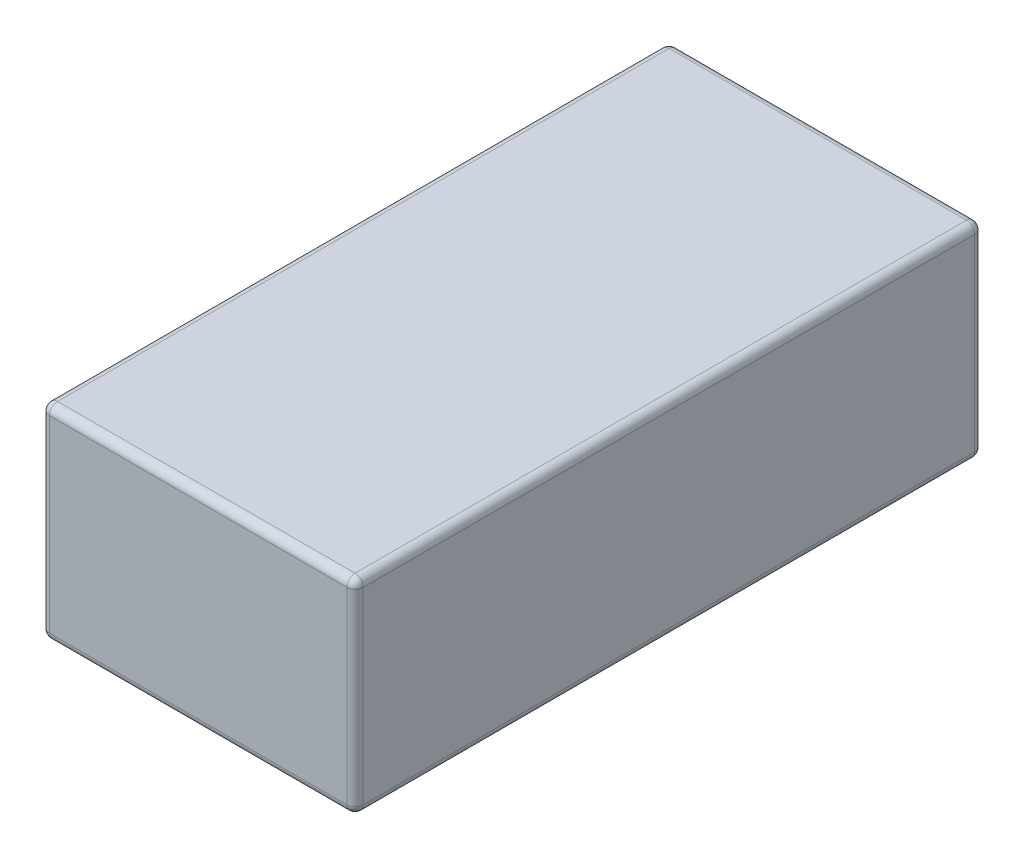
ISO-10303-21;
HEADER;
FILE_DESCRIPTION(('STEP AP214'),'2;1');
FILE_NAME('part.step','',(''),(''),'','','');
FILE_SCHEMA(('AUTOMOTIVE_DESIGN { 1 0 10303 214 1 1 1 1 }'));
ENDSEC;
DATA;
#1=APPLICATION_CONTEXT('core data for automotive mechanical design processes');
#2=APPLICATION_PROTOCOL_DEFINITION('international standard','automotive_design',2000,#1);
#3=PRODUCT_CONTEXT('',#1,'mechanical');
#4=PRODUCT('Part','Part','',(#3));
#5=PRODUCT_RELATED_PRODUCT_CATEGORY('part','',(#4));
#6=PRODUCT_DEFINITION_FORMATION('','',#4);
#7=PRODUCT_DEFINITION_CONTEXT('part definition',#1,'design');
#8=PRODUCT_DEFINITION('design','',#6,#7);
#9=PRODUCT_DEFINITION_SHAPE('','',#8);
#10=(LENGTH_UNIT() NAMED_UNIT(*) SI_UNIT(.MILLI.,.METRE.));
#11=(NAMED_UNIT(*) PLANE_ANGLE_UNIT() SI_UNIT($,.RADIAN.));
#12=(NAMED_UNIT(*) SI_UNIT($,.STERADIAN.) SOLID_ANGLE_UNIT());
#13=UNCERTAINTY_MEASURE_WITH_UNIT(LENGTH_MEASURE(1.E-05),#10,'distance_accuracy_value','');
#14=(GEOMETRIC_REPRESENTATION_CONTEXT(3) GLOBAL_UNCERTAINTY_ASSIGNED_CONTEXT((#13)) GLOBAL_UNIT_ASSIGNED_CONTEXT((#10,
#11,#12)) REPRESENTATION_CONTEXT('',''));
#15=CARTESIAN_POINT('',(0.,0.,0.));
#16=DIRECTION('',(0.,0.,1.));
#17=DIRECTION('',(1.,0.,0.));
#18=AXIS2_PLACEMENT_3D('',#15,#16,#17);
#19=CARTESIAN_POINT('',(57.5,37.5,115.));
#20=DIRECTION('',(-1.,0.,0.));
#21=DIRECTION('',(0.,-1.,0.));
#22=AXIS2_PLACEMENT_3D('',#19,#20,#21);
#23=PLANE('',#22);
#24=DIRECTION('',(0.,1.,0.));
#25=VECTOR('',#24,1.);
#26=CARTESIAN_POINT('',(57.5,-37.5,112.));
#27=LINE('',#26,#25);
#28=CARTESIAN_POINT('',(57.5,34.5,112.));
#29=VERTEX_POINT('',#28);
#30=CARTESIAN_POINT('',(57.5,-34.5,112.));
#31=VERTEX_POINT('',#30);
#32=EDGE_CURVE('E141',#29,#31,#27,.F.);
#33=ORIENTED_EDGE('',*,*,#32,.T.);
#34=DIRECTION('',(0.,0.,-1.));
#35=VECTOR('',#34,1.);
#36=CARTESIAN_POINT('',(57.5,-34.5,115.));
#37=LINE('',#36,#35);
#38=CARTESIAN_POINT('',(57.5,-34.5,-112.));
#39=VERTEX_POINT('',#38);
#40=EDGE_CURVE('E137',#31,#39,#37,.T.);
#41=ORIENTED_EDGE('',*,*,#40,.T.);
#42=DIRECTION('',(0.,1.,0.));
#43=VECTOR('',#42,1.);
#44=CARTESIAN_POINT('',(57.5,37.5,-112.));
#45=LINE('',#44,#43);
#46=CARTESIAN_POINT('',(57.5,34.5,-112.));
#47=VERTEX_POINT('',#46);
#48=EDGE_CURVE('E132',#39,#47,#45,.T.);
#49=ORIENTED_EDGE('',*,*,#48,.T.);
#50=DIRECTION('',(0.,0.,-1.));
#51=VECTOR('',#50,1.);
#52=CARTESIAN_POINT('',(57.5,34.5,115.));
#53=LINE('',#52,#51);
#54=EDGE_CURVE('E134',#47,#29,#53,.F.);
#55=ORIENTED_EDGE('',*,*,#54,.T.);
#56=EDGE_LOOP('',(#33,#41,#49,#55));
#57=FACE_BOUND('',#56,.T.);
#58=ADVANCED_FACE('F39',(#57),#23,.F.);
#59=CARTESIAN_POINT('',(-57.5,37.5,115.));
#60=DIRECTION('',(0.,-1.,0.));
#61=DIRECTION('',(0.,0.,-1.));
#62=AXIS2_PLACEMENT_3D('',#59,#60,#61);
#63=PLANE('',#62);
#64=DIRECTION('',(0.,0.,-1.));
#65=VECTOR('',#64,1.);
#66=CARTESIAN_POINT('',(-54.5,37.5,115.));
#67=LINE('',#66,#65);
#68=CARTESIAN_POINT('',(-54.5,37.5,-112.));
#69=VERTEX_POINT('',#68);
#70=CARTESIAN_POINT('',(-54.5,37.5,112.));
#71=VERTEX_POINT('',#70);
#72=EDGE_CURVE('E263',#69,#71,#67,.F.);
#73=ORIENTED_EDGE('',*,*,#72,.T.);
#74=DIRECTION('',(-1.,0.,0.));
#75=VECTOR('',#74,1.);
#76=CARTESIAN_POINT('',(57.5,37.5,112.));
#77=LINE('',#76,#75);
#78=CARTESIAN_POINT('',(54.5,37.5,112.));
#79=VERTEX_POINT('',#78);
#80=EDGE_CURVE('E266',#71,#79,#77,.F.);
#81=ORIENTED_EDGE('',*,*,#80,.T.);
#82=DIRECTION('',(0.,0.,-1.));
#83=VECTOR('',#82,1.);
#84=CARTESIAN_POINT('',(54.5,37.5,115.));
#85=LINE('',#84,#83);
#86=CARTESIAN_POINT('',(54.5,37.5,-112.));
#87=VERTEX_POINT('',#86);
#88=EDGE_CURVE('E253',#79,#87,#85,.T.);
#89=ORIENTED_EDGE('',*,*,#88,.T.);
#90=DIRECTION('',(-1.,0.,0.));
#91=VECTOR('',#90,1.);
#92=CARTESIAN_POINT('',(-57.5,37.5,-112.));
#93=LINE('',#92,#91);
#94=EDGE_CURVE('E257',#87,#69,#93,.T.);
#95=ORIENTED_EDGE('',*,*,#94,.T.);
#96=EDGE_LOOP('',(#73,#81,#89,#95));
#97=FACE_BOUND('',#96,.T.);
#98=ADVANCED_FACE('F376',(#97),#63,.F.);
#99=CARTESIAN_POINT('',(-57.5,37.5,115.));
#100=DIRECTION('',(1.,0.,0.));
#101=DIRECTION('',(0.,1.,0.));
#102=AXIS2_PLACEMENT_3D('',#99,#100,#101);
#103=PLANE('',#102);
#104=DIRECTION('',(0.,0.,-1.));
#105=VECTOR('',#104,1.);
#106=CARTESIAN_POINT('',(-57.5,-34.5,115.));
#107=LINE('',#106,#105);
#108=CARTESIAN_POINT('',(-57.5,-34.5,-112.));
#109=VERTEX_POINT('',#108);
#110=CARTESIAN_POINT('',(-57.5,-34.5,112.));
#111=VERTEX_POINT('',#110);
#112=EDGE_CURVE('E242',#109,#111,#107,.F.);
#113=ORIENTED_EDGE('',*,*,#112,.T.);
#114=DIRECTION('',(0.,-1.,0.));
#115=VECTOR('',#114,1.);
#116=CARTESIAN_POINT('',(-57.5,37.5,112.));
#117=LINE('',#116,#115);
#118=CARTESIAN_POINT('',(-57.5,34.5,112.));
#119=VERTEX_POINT('',#118);
#120=EDGE_CURVE('E246',#111,#119,#117,.F.);
#121=ORIENTED_EDGE('',*,*,#120,.T.);
#122=DIRECTION('',(0.,0.,-1.));
#123=VECTOR('',#122,1.);
#124=CARTESIAN_POINT('',(-57.5,34.5,115.));
#125=LINE('',#124,#123);
#126=CARTESIAN_POINT('',(-57.5,34.5,-112.));
#127=VERTEX_POINT('',#126);
#128=EDGE_CURVE('E238',#119,#127,#125,.T.);
#129=ORIENTED_EDGE('',*,*,#128,.T.);
#130=DIRECTION('',(0.,-1.,0.));
#131=VECTOR('',#130,1.);
#132=CARTESIAN_POINT('',(-57.5,37.5,-112.));
#133=LINE('',#132,#131);
#134=EDGE_CURVE('E243',#127,#109,#133,.T.);
#135=ORIENTED_EDGE('',*,*,#134,.T.);
#136=EDGE_LOOP('',(#113,#121,#129,#135));
#137=FACE_BOUND('',#136,.T.);
#138=ADVANCED_FACE('F247',(#137),#103,.F.);
#139=CARTESIAN_POINT('',(-57.5,-37.5,115.));
#140=DIRECTION('',(0.,1.,0.));
#141=DIRECTION('',(0.,0.,1.));
#142=AXIS2_PLACEMENT_3D('',#139,#140,#141);
#143=PLANE('',#142);
#144=DIRECTION('',(1.,0.,0.));
#145=VECTOR('',#144,1.);
#146=CARTESIAN_POINT('',(-57.5,-37.5,-112.));
#147=LINE('',#146,#145);
#148=CARTESIAN_POINT('',(-54.5,-37.5,-112.));
#149=VERTEX_POINT('',#148);
#150=CARTESIAN_POINT('',(54.5,-37.5,-112.));
#151=VERTEX_POINT('',#150);
#152=EDGE_CURVE('E314',#149,#151,#147,.T.);
#153=ORIENTED_EDGE('',*,*,#152,.T.);
#154=DIRECTION('',(0.,0.,-1.));
#155=VECTOR('',#154,1.);
#156=CARTESIAN_POINT('',(54.5,-37.5,115.));
#157=LINE('',#156,#155);
#158=CARTESIAN_POINT('',(54.5,-37.5,112.));
#159=VERTEX_POINT('',#158);
#160=EDGE_CURVE('E308',#151,#159,#157,.F.);
#161=ORIENTED_EDGE('',*,*,#160,.T.);
#162=DIRECTION('',(1.,0.,0.));
#163=VECTOR('',#162,1.);
#164=CARTESIAN_POINT('',(-57.5,-37.5,112.));
#165=LINE('',#164,#163);
#166=CARTESIAN_POINT('',(-54.5,-37.5,112.));
#167=VERTEX_POINT('',#166);
#168=EDGE_CURVE('E301',#159,#167,#165,.F.);
#169=ORIENTED_EDGE('',*,*,#168,.T.);
#170=DIRECTION('',(0.,0.,-1.));
#171=VECTOR('',#170,1.);
#172=CARTESIAN_POINT('',(-54.5,-37.5,115.));
#173=LINE('',#172,#171);
#174=EDGE_CURVE('E309',#167,#149,#173,.T.);
#175=ORIENTED_EDGE('',*,*,#174,.T.);
#176=EDGE_LOOP('',(#153,#161,#169,#175));
#177=FACE_BOUND('',#176,.T.);
#178=ADVANCED_FACE('F312',(#177),#143,.F.);
#179=CARTESIAN_POINT('',(0.,0.,115.));
#180=DIRECTION('',(0.,0.,1.));
#181=DIRECTION('',(1.,0.,0.));
#182=AXIS2_PLACEMENT_3D('',#179,#180,#181);
#183=PLANE('',#182);
#184=DIRECTION('',(0.,-1.,0.));
#185=VECTOR('',#184,1.);
#186=CARTESIAN_POINT('',(-54.5,-37.5,115.));
#187=LINE('',#186,#185);
#188=CARTESIAN_POINT('',(-54.5,34.5,115.));
#189=VERTEX_POINT('',#188);
#190=CARTESIAN_POINT('',(-54.5,-34.5,115.));
#191=VERTEX_POINT('',#190);
#192=EDGE_CURVE('E326',#189,#191,#187,.T.);
#193=ORIENTED_EDGE('',*,*,#192,.T.);
#194=DIRECTION('',(1.,0.,0.));
#195=VECTOR('',#194,1.);
#196=CARTESIAN_POINT('',(57.5,-34.5,115.));
#197=LINE('',#196,#195);
#198=CARTESIAN_POINT('',(54.5,-34.5,115.));
#199=VERTEX_POINT('',#198);
#200=EDGE_CURVE('E330',#191,#199,#197,.T.);
#201=ORIENTED_EDGE('',*,*,#200,.T.);
#202=DIRECTION('',(0.,1.,0.));
#203=VECTOR('',#202,1.);
#204=CARTESIAN_POINT('',(54.5,37.5,115.));
#205=LINE('',#204,#203);
#206=CARTESIAN_POINT('',(54.5,34.5,115.));
#207=VERTEX_POINT('',#206);
#208=EDGE_CURVE('E320',#199,#207,#205,.T.);
#209=ORIENTED_EDGE('',*,*,#208,.T.);
#210=DIRECTION('',(-1.,0.,0.));
#211=VECTOR('',#210,1.);
#212=CARTESIAN_POINT('',(-57.5,34.5,115.));
#213=LINE('',#212,#211);
#214=EDGE_CURVE('E317',#207,#189,#213,.T.);
#215=ORIENTED_EDGE('',*,*,#214,.T.);
#216=EDGE_LOOP('',(#193,#201,#209,#215));
#217=FACE_BOUND('',#216,.T.);
#218=ADVANCED_FACE('F359',(#217),#183,.T.);
#219=CARTESIAN_POINT('',(0.,0.,-115.));
#220=DIRECTION('',(0.,0.,1.));
#221=DIRECTION('',(1.,0.,0.));
#222=AXIS2_PLACEMENT_3D('',#219,#220,#221);
#223=PLANE('',#222);
#224=DIRECTION('',(-1.,0.,0.));
#225=VECTOR('',#224,1.);
#226=CARTESIAN_POINT('',(0.,34.5,-115.));
#227=LINE('',#226,#225);
#228=CARTESIAN_POINT('',(-54.5,34.5,-115.));
#229=VERTEX_POINT('',#228);
#230=CARTESIAN_POINT('',(54.5,34.5,-115.));
#231=VERTEX_POINT('',#230);
#232=EDGE_CURVE('E270',#229,#231,#227,.F.);
#233=ORIENTED_EDGE('',*,*,#232,.T.);
#234=DIRECTION('',(0.,1.,0.));
#235=VECTOR('',#234,1.);
#236=CARTESIAN_POINT('',(54.5,0.,-115.));
#237=LINE('',#236,#235);
#238=CARTESIAN_POINT('',(54.5,-34.5,-115.));
#239=VERTEX_POINT('',#238);
#240=EDGE_CURVE('E11',#231,#239,#237,.F.);
#241=ORIENTED_EDGE('',*,*,#240,.T.);
#242=DIRECTION('',(1.,0.,0.));
#243=VECTOR('',#242,1.);
#244=CARTESIAN_POINT('',(0.,-34.5,-115.));
#245=LINE('',#244,#243);
#246=CARTESIAN_POINT('',(-54.5,-34.5,-115.));
#247=VERTEX_POINT('',#246);
#248=EDGE_CURVE('E49',#239,#247,#245,.F.);
#249=ORIENTED_EDGE('',*,*,#248,.T.);
#250=DIRECTION('',(0.,-1.,0.));
#251=VECTOR('',#250,1.);
#252=CARTESIAN_POINT('',(-54.5,0.,-115.));
#253=LINE('',#252,#251);
#254=EDGE_CURVE('E273',#247,#229,#253,.F.);
#255=ORIENTED_EDGE('',*,*,#254,.T.);
#256=EDGE_LOOP('',(#233,#241,#249,#255));
#257=FACE_BOUND('',#256,.T.);
#258=ADVANCED_FACE('F530',(#257),#223,.F.);
#259=CARTESIAN_POINT('',(-54.5,34.5,115.));
#260=DIRECTION('',(0.,0.,-1.));
#261=DIRECTION('',(-1.,0.,0.));
#262=AXIS2_PLACEMENT_3D('',#259,#260,#261);
#263=CYLINDRICAL_SURFACE('',#262,3.);
#264=CARTESIAN_POINT('',(-54.5,34.5,112.));
#265=DIRECTION('',(0.,0.,1.));
#266=DIRECTION('',(1.,0.,0.));
#267=AXIS2_PLACEMENT_3D('',#264,#265,#266);
#268=CIRCLE('',#267,3.);
#269=EDGE_CURVE('E43',#71,#119,#268,.T.);
#270=ORIENTED_EDGE('',*,*,#269,.F.);
#271=ORIENTED_EDGE('',*,*,#72,.F.);
#272=CARTESIAN_POINT('',(-54.5,34.5,-112.));
#273=DIRECTION('',(0.,0.,-1.));
#274=DIRECTION('',(-1.,0.,0.));
#275=AXIS2_PLACEMENT_3D('',#272,#273,#274);
#276=CIRCLE('',#275,3.);
#277=EDGE_CURVE('E219',#127,#69,#276,.T.);
#278=ORIENTED_EDGE('',*,*,#277,.F.);
#279=ORIENTED_EDGE('',*,*,#128,.F.);
#280=EDGE_LOOP('',(#270,#271,#278,#279));
#281=FACE_BOUND('',#280,.T.);
#282=ADVANCED_FACE('F41',(#281),#263,.T.);
#283=CARTESIAN_POINT('',(-54.5,34.5,112.));
#284=DIRECTION('',(0.,0.,1.));
#285=DIRECTION('',(1.,0.,0.));
#286=AXIS2_PLACEMENT_3D('',#283,#284,#285);
#287=SPHERICAL_SURFACE('',#286,3.);
#288=CARTESIAN_POINT('',(-54.5,34.5,112.));
#289=DIRECTION('',(-1.,0.,0.));
#290=DIRECTION('',(0.,0.,1.));
#291=AXIS2_PLACEMENT_3D('',#288,#289,#290);
#292=CIRCLE('',#291,3.);
#293=EDGE_CURVE('E213',#71,#189,#292,.F.);
#294=ORIENTED_EDGE('',*,*,#293,.F.);
#295=ORIENTED_EDGE('',*,*,#269,.T.);
#296=CARTESIAN_POINT('',(-54.5,34.5,112.));
#297=DIRECTION('',(0.,1.,0.));
#298=DIRECTION('',(0.,0.,1.));
#299=AXIS2_PLACEMENT_3D('',#296,#297,#298);
#300=CIRCLE('',#299,3.);
#301=EDGE_CURVE('E217',#189,#119,#300,.F.);
#302=ORIENTED_EDGE('',*,*,#301,.F.);
#303=EDGE_LOOP('',(#294,#295,#302));
#304=FACE_BOUND('',#303,.T.);
#305=ADVANCED_FACE('F233',(#304),#287,.T.);
#306=CARTESIAN_POINT('',(-54.5,34.5,-112.));
#307=DIRECTION('',(0.,0.,1.));
#308=DIRECTION('',(1.,0.,0.));
#309=AXIS2_PLACEMENT_3D('',#306,#307,#308);
#310=SPHERICAL_SURFACE('',#309,3.);
#311=CARTESIAN_POINT('',(-54.5,34.5,-112.));
#312=DIRECTION('',(0.,1.,0.));
#313=DIRECTION('',(0.,0.,1.));
#314=AXIS2_PLACEMENT_3D('',#311,#312,#313);
#315=CIRCLE('',#314,3.);
#316=EDGE_CURVE('E205',#127,#229,#315,.F.);
#317=ORIENTED_EDGE('',*,*,#316,.F.);
#318=ORIENTED_EDGE('',*,*,#277,.T.);
#319=CARTESIAN_POINT('',(-54.5,34.5,-112.));
#320=DIRECTION('',(-1.,0.,0.));
#321=DIRECTION('',(0.,0.,1.));
#322=AXIS2_PLACEMENT_3D('',#319,#320,#321);
#323=CIRCLE('',#322,3.);
#324=EDGE_CURVE('E209',#229,#69,#323,.F.);
#325=ORIENTED_EDGE('',*,*,#324,.F.);
#326=EDGE_LOOP('',(#317,#318,#325));
#327=FACE_BOUND('',#326,.T.);
#328=ADVANCED_FACE('F509',(#327),#310,.T.);
#329=CARTESIAN_POINT('',(-54.5,0.,112.));
#330=DIRECTION('',(0.,1.,0.));
#331=DIRECTION('',(-1.,0.,0.));
#332=AXIS2_PLACEMENT_3D('',#329,#330,#331);
#333=CYLINDRICAL_SURFACE('',#332,3.);
#334=ORIENTED_EDGE('',*,*,#301,.T.);
#335=ORIENTED_EDGE('',*,*,#120,.F.);
#336=CARTESIAN_POINT('',(-54.5,-34.5,112.));
#337=DIRECTION('',(0.,-1.,0.));
#338=DIRECTION('',(0.,0.,-1.));
#339=AXIS2_PLACEMENT_3D('',#336,#337,#338);
#340=CIRCLE('',#339,3.);
#341=EDGE_CURVE('E197',#191,#111,#340,.T.);
#342=ORIENTED_EDGE('',*,*,#341,.F.);
#343=ORIENTED_EDGE('',*,*,#192,.F.);
#344=EDGE_LOOP('',(#334,#335,#342,#343));
#345=FACE_BOUND('',#344,.T.);
#346=ADVANCED_FACE('F501',(#345),#333,.T.);
#347=CARTESIAN_POINT('',(0.,34.5,112.));
#348=DIRECTION('',(1.,0.,0.));
#349=DIRECTION('',(0.,0.,-1.));
#350=AXIS2_PLACEMENT_3D('',#347,#348,#349);
#351=CYLINDRICAL_SURFACE('',#350,3.);
#352=ORIENTED_EDGE('',*,*,#293,.T.);
#353=ORIENTED_EDGE('',*,*,#214,.F.);
#354=CARTESIAN_POINT('',(54.5,34.5,112.));
#355=DIRECTION('',(1.,0.,0.));
#356=DIRECTION('',(0.,0.,-1.));
#357=AXIS2_PLACEMENT_3D('',#354,#355,#356);
#358=CIRCLE('',#357,3.);
#359=EDGE_CURVE('E193',#79,#207,#358,.T.);
#360=ORIENTED_EDGE('',*,*,#359,.F.);
#361=ORIENTED_EDGE('',*,*,#80,.F.);
#362=EDGE_LOOP('',(#352,#353,#360,#361));
#363=FACE_BOUND('',#362,.T.);
#364=ADVANCED_FACE('F362',(#363),#351,.T.);
#365=CARTESIAN_POINT('',(54.5,34.5,115.));
#366=DIRECTION('',(0.,0.,-1.));
#367=DIRECTION('',(-1.,0.,0.));
#368=AXIS2_PLACEMENT_3D('',#365,#366,#367);
#369=CYLINDRICAL_SURFACE('',#368,3.);
#370=CARTESIAN_POINT('',(54.5,34.5,-112.));
#371=DIRECTION('',(0.,0.,-1.));
#372=DIRECTION('',(-1.,0.,0.));
#373=AXIS2_PLACEMENT_3D('',#370,#371,#372);
#374=CIRCLE('',#373,3.);
#375=EDGE_CURVE('E148',#87,#47,#374,.T.);
#376=ORIENTED_EDGE('',*,*,#375,.F.);
#377=ORIENTED_EDGE('',*,*,#88,.F.);
#378=CARTESIAN_POINT('',(54.5,34.5,112.));
#379=DIRECTION('',(0.,0.,1.));
#380=DIRECTION('',(1.,0.,0.));
#381=AXIS2_PLACEMENT_3D('',#378,#379,#380);
#382=CIRCLE('',#381,3.);
#383=EDGE_CURVE('E150',#29,#79,#382,.T.);
#384=ORIENTED_EDGE('',*,*,#383,.F.);
#385=ORIENTED_EDGE('',*,*,#54,.F.);
#386=EDGE_LOOP('',(#376,#377,#384,#385));
#387=FACE_BOUND('',#386,.T.);
#388=ADVANCED_FACE('F146',(#387),#369,.T.);
#389=CARTESIAN_POINT('',(-57.5,34.5,-112.));
#390=DIRECTION('',(-1.,0.,0.));
#391=DIRECTION('',(0.,0.,1.));
#392=AXIS2_PLACEMENT_3D('',#389,#390,#391);
#393=CYLINDRICAL_SURFACE('',#392,3.);
#394=ORIENTED_EDGE('',*,*,#324,.T.);
#395=ORIENTED_EDGE('',*,*,#94,.F.);
#396=CARTESIAN_POINT('',(54.5,34.5,-112.));
#397=DIRECTION('',(1.,0.,0.));
#398=DIRECTION('',(0.,0.,-1.));
#399=AXIS2_PLACEMENT_3D('',#396,#397,#398);
#400=CIRCLE('',#399,3.);
#401=EDGE_CURVE('E160',#231,#87,#400,.T.);
#402=ORIENTED_EDGE('',*,*,#401,.F.);
#403=ORIENTED_EDGE('',*,*,#232,.F.);
#404=EDGE_LOOP('',(#394,#395,#402,#403));
#405=FACE_BOUND('',#404,.T.);
#406=ADVANCED_FACE('F478',(#405),#393,.T.);
#407=CARTESIAN_POINT('',(-54.5,37.5,-112.));
#408=DIRECTION('',(0.,-1.,0.));
#409=DIRECTION('',(1.,0.,0.));
#410=AXIS2_PLACEMENT_3D('',#407,#408,#409);
#411=CYLINDRICAL_SURFACE('',#410,3.);
#412=ORIENTED_EDGE('',*,*,#316,.T.);
#413=ORIENTED_EDGE('',*,*,#254,.F.);
#414=CARTESIAN_POINT('',(-54.5,-34.5,-112.));
#415=DIRECTION('',(0.,-1.,0.));
#416=DIRECTION('',(0.,0.,-1.));
#417=AXIS2_PLACEMENT_3D('',#414,#415,#416);
#418=CIRCLE('',#417,3.);
#419=EDGE_CURVE('E185',#109,#247,#418,.T.);
#420=ORIENTED_EDGE('',*,*,#419,.F.);
#421=ORIENTED_EDGE('',*,*,#134,.F.);
#422=EDGE_LOOP('',(#412,#413,#420,#421));
#423=FACE_BOUND('',#422,.T.);
#424=ADVANCED_FACE('F341',(#423),#411,.T.);
#425=CARTESIAN_POINT('',(-54.5,-34.5,115.));
#426=DIRECTION('',(0.,0.,-1.));
#427=DIRECTION('',(-1.,0.,0.));
#428=AXIS2_PLACEMENT_3D('',#425,#426,#427);
#429=CYLINDRICAL_SURFACE('',#428,3.);
#430=CARTESIAN_POINT('',(-54.5,-34.5,112.));
#431=DIRECTION('',(0.,0.,1.));
#432=DIRECTION('',(1.,0.,0.));
#433=AXIS2_PLACEMENT_3D('',#430,#431,#432);
#434=CIRCLE('',#433,3.);
#435=EDGE_CURVE('E201',#111,#167,#434,.T.);
#436=ORIENTED_EDGE('',*,*,#435,.F.);
#437=ORIENTED_EDGE('',*,*,#112,.F.);
#438=CARTESIAN_POINT('',(-54.5,-34.5,-112.));
#439=DIRECTION('',(0.,0.,-1.));
#440=DIRECTION('',(-1.,0.,0.));
#441=AXIS2_PLACEMENT_3D('',#438,#439,#440);
#442=CIRCLE('',#441,3.);
#443=EDGE_CURVE('E181',#149,#109,#442,.T.);
#444=ORIENTED_EDGE('',*,*,#443,.F.);
#445=ORIENTED_EDGE('',*,*,#174,.F.);
#446=EDGE_LOOP('',(#436,#437,#444,#445));
#447=FACE_BOUND('',#446,.T.);
#448=ADVANCED_FACE('F339',(#447),#429,.T.);
#449=CARTESIAN_POINT('',(-54.5,-34.5,112.));
#450=DIRECTION('',(0.,0.,1.));
#451=DIRECTION('',(1.,0.,0.));
#452=AXIS2_PLACEMENT_3D('',#449,#450,#451);
#453=SPHERICAL_SURFACE('',#452,3.);
#454=ORIENTED_EDGE('',*,*,#341,.T.);
#455=ORIENTED_EDGE('',*,*,#435,.T.);
#456=CARTESIAN_POINT('',(-54.5,-34.5,112.));
#457=DIRECTION('',(-1.,0.,0.));
#458=DIRECTION('',(0.,0.,1.));
#459=AXIS2_PLACEMENT_3D('',#456,#457,#458);
#460=CIRCLE('',#459,3.);
#461=EDGE_CURVE('E171',#191,#167,#460,.F.);
#462=ORIENTED_EDGE('',*,*,#461,.F.);
#463=EDGE_LOOP('',(#454,#455,#462));
#464=FACE_BOUND('',#463,.T.);
#465=ADVANCED_FACE('F366',(#464),#453,.T.);
#466=CARTESIAN_POINT('',(54.5,34.5,112.));
#467=DIRECTION('',(0.,0.,1.));
#468=DIRECTION('',(1.,0.,0.));
#469=AXIS2_PLACEMENT_3D('',#466,#467,#468);
#470=SPHERICAL_SURFACE('',#469,3.);
#471=ORIENTED_EDGE('',*,*,#383,.T.);
#472=ORIENTED_EDGE('',*,*,#359,.T.);
#473=CARTESIAN_POINT('',(54.5,34.5,112.));
#474=DIRECTION('',(0.,1.,0.));
#475=DIRECTION('',(0.,0.,1.));
#476=AXIS2_PLACEMENT_3D('',#473,#474,#475);
#477=CIRCLE('',#476,3.);
#478=EDGE_CURVE('E165',#29,#207,#477,.F.);
#479=ORIENTED_EDGE('',*,*,#478,.F.);
#480=EDGE_LOOP('',(#471,#472,#479));
#481=FACE_BOUND('',#480,.T.);
#482=ADVANCED_FACE('F364',(#481),#470,.T.);
#483=CARTESIAN_POINT('',(54.5,34.5,-112.));
#484=DIRECTION('',(0.,0.,1.));
#485=DIRECTION('',(1.,0.,0.));
#486=AXIS2_PLACEMENT_3D('',#483,#484,#485);
#487=SPHERICAL_SURFACE('',#486,3.);
#488=ORIENTED_EDGE('',*,*,#401,.T.);
#489=ORIENTED_EDGE('',*,*,#375,.T.);
#490=CARTESIAN_POINT('',(54.5,34.5,-112.));
#491=DIRECTION('',(0.,1.,0.));
#492=DIRECTION('',(0.,0.,1.));
#493=AXIS2_PLACEMENT_3D('',#490,#491,#492);
#494=CIRCLE('',#493,3.);
#495=EDGE_CURVE('E157',#231,#47,#494,.F.);
#496=ORIENTED_EDGE('',*,*,#495,.F.);
#497=EDGE_LOOP('',(#488,#489,#496));
#498=FACE_BOUND('',#497,.T.);
#499=ADVANCED_FACE('F156',(#498),#487,.T.);
#500=CARTESIAN_POINT('',(-54.5,-34.5,-112.));
#501=DIRECTION('',(0.,0.,1.));
#502=DIRECTION('',(1.,0.,0.));
#503=AXIS2_PLACEMENT_3D('',#500,#501,#502);
#504=SPHERICAL_SURFACE('',#503,3.);
#505=ORIENTED_EDGE('',*,*,#443,.T.);
#506=ORIENTED_EDGE('',*,*,#419,.T.);
#507=CARTESIAN_POINT('',(-54.5,-34.5,-112.));
#508=DIRECTION('',(-1.,0.,0.));
#509=DIRECTION('',(0.,0.,1.));
#510=AXIS2_PLACEMENT_3D('',#507,#508,#509);
#511=CIRCLE('',#510,3.);
#512=EDGE_CURVE('E166',#149,#247,#511,.F.);
#513=ORIENTED_EDGE('',*,*,#512,.F.);
#514=EDGE_LOOP('',(#505,#506,#513));
#515=FACE_BOUND('',#514,.T.);
#516=ADVANCED_FACE('F343',(#515),#504,.T.);
#517=CARTESIAN_POINT('',(0.,-34.5,112.));
#518=DIRECTION('',(-1.,0.,0.));
#519=DIRECTION('',(0.,0.,1.));
#520=AXIS2_PLACEMENT_3D('',#517,#518,#519);
#521=CYLINDRICAL_SURFACE('',#520,3.);
#522=ORIENTED_EDGE('',*,*,#461,.T.);
#523=ORIENTED_EDGE('',*,*,#168,.F.);
#524=CARTESIAN_POINT('',(54.5,-34.5,112.));
#525=DIRECTION('',(1.,0.,0.));
#526=DIRECTION('',(0.,0.,-1.));
#527=AXIS2_PLACEMENT_3D('',#524,#525,#526);
#528=CIRCLE('',#527,3.);
#529=EDGE_CURVE('E174',#199,#159,#528,.T.);
#530=ORIENTED_EDGE('',*,*,#529,.F.);
#531=ORIENTED_EDGE('',*,*,#200,.F.);
#532=EDGE_LOOP('',(#522,#523,#530,#531));
#533=FACE_BOUND('',#532,.T.);
#534=ADVANCED_FACE('F303',(#533),#521,.T.);
#535=CARTESIAN_POINT('',(54.5,0.,112.));
#536=DIRECTION('',(0.,-1.,0.));
#537=DIRECTION('',(1.,0.,0.));
#538=AXIS2_PLACEMENT_3D('',#535,#536,#537);
#539=CYLINDRICAL_SURFACE('',#538,3.);
#540=ORIENTED_EDGE('',*,*,#478,.T.);
#541=ORIENTED_EDGE('',*,*,#208,.F.);
#542=CARTESIAN_POINT('',(54.5,-34.5,112.));
#543=DIRECTION('',(0.,-1.,0.));
#544=DIRECTION('',(0.,0.,-1.));
#545=AXIS2_PLACEMENT_3D('',#542,#543,#544);
#546=CIRCLE('',#545,3.);
#547=EDGE_CURVE('E289',#31,#199,#546,.T.);
#548=ORIENTED_EDGE('',*,*,#547,.F.);
#549=ORIENTED_EDGE('',*,*,#32,.F.);
#550=EDGE_LOOP('',(#540,#541,#548,#549));
#551=FACE_BOUND('',#550,.T.);
#552=ADVANCED_FACE('F356',(#551),#539,.T.);
#553=CARTESIAN_POINT('',(54.5,37.5,-112.));
#554=DIRECTION('',(0.,1.,0.));
#555=DIRECTION('',(-1.,0.,0.));
#556=AXIS2_PLACEMENT_3D('',#553,#554,#555);
#557=CYLINDRICAL_SURFACE('',#556,3.);
#558=ORIENTED_EDGE('',*,*,#495,.T.);
#559=ORIENTED_EDGE('',*,*,#48,.F.);
#560=CARTESIAN_POINT('',(54.5,-34.5,-112.));
#561=DIRECTION('',(0.,-1.,0.));
#562=DIRECTION('',(0.,0.,-1.));
#563=AXIS2_PLACEMENT_3D('',#560,#561,#562);
#564=CIRCLE('',#563,3.);
#565=EDGE_CURVE('E286',#239,#39,#564,.T.);
#566=ORIENTED_EDGE('',*,*,#565,.F.);
#567=ORIENTED_EDGE('',*,*,#240,.F.);
#568=EDGE_LOOP('',(#558,#559,#566,#567));
#569=FACE_BOUND('',#568,.T.);
#570=ADVANCED_FACE('F163',(#569),#557,.T.);
#571=CARTESIAN_POINT('',(-57.5,-34.5,-112.));
#572=DIRECTION('',(1.,0.,0.));
#573=DIRECTION('',(0.,0.,-1.));
#574=AXIS2_PLACEMENT_3D('',#571,#572,#573);
#575=CYLINDRICAL_SURFACE('',#574,3.);
#576=ORIENTED_EDGE('',*,*,#512,.T.);
#577=ORIENTED_EDGE('',*,*,#248,.F.);
#578=CARTESIAN_POINT('',(54.5,-34.5,-112.));
#579=DIRECTION('',(1.,0.,0.));
#580=DIRECTION('',(0.,0.,-1.));
#581=AXIS2_PLACEMENT_3D('',#578,#579,#580);
#582=CIRCLE('',#581,3.);
#583=EDGE_CURVE('E57',#151,#239,#582,.T.);
#584=ORIENTED_EDGE('',*,*,#583,.F.);
#585=ORIENTED_EDGE('',*,*,#152,.F.);
#586=EDGE_LOOP('',(#576,#577,#584,#585));
#587=FACE_BOUND('',#586,.T.);
#588=ADVANCED_FACE('F345',(#587),#575,.T.);
#589=CARTESIAN_POINT('',(54.5,-34.5,112.));
#590=DIRECTION('',(0.,0.,1.));
#591=DIRECTION('',(1.,0.,0.));
#592=AXIS2_PLACEMENT_3D('',#589,#590,#591);
#593=SPHERICAL_SURFACE('',#592,3.);
#594=ORIENTED_EDGE('',*,*,#547,.T.);
#595=ORIENTED_EDGE('',*,*,#529,.T.);
#596=CARTESIAN_POINT('',(54.5,-34.5,112.));
#597=DIRECTION('',(0.,0.,1.));
#598=DIRECTION('',(1.,0.,0.));
#599=AXIS2_PLACEMENT_3D('',#596,#597,#598);
#600=CIRCLE('',#599,3.);
#601=EDGE_CURVE('E281',#31,#159,#600,.F.);
#602=ORIENTED_EDGE('',*,*,#601,.F.);
#603=EDGE_LOOP('',(#594,#595,#602));
#604=FACE_BOUND('',#603,.T.);
#605=ADVANCED_FACE('F298',(#604),#593,.T.);
#606=CARTESIAN_POINT('',(54.5,-34.5,-112.));
#607=DIRECTION('',(0.,0.,1.));
#608=DIRECTION('',(1.,0.,0.));
#609=AXIS2_PLACEMENT_3D('',#606,#607,#608);
#610=SPHERICAL_SURFACE('',#609,3.);
#611=ORIENTED_EDGE('',*,*,#583,.T.);
#612=ORIENTED_EDGE('',*,*,#565,.T.);
#613=CARTESIAN_POINT('',(54.5,-34.5,-112.));
#614=DIRECTION('',(0.,0.,-1.));
#615=DIRECTION('',(-1.,0.,0.));
#616=AXIS2_PLACEMENT_3D('',#613,#614,#615);
#617=CIRCLE('',#616,3.);
#618=EDGE_CURVE('E278',#151,#39,#617,.F.);
#619=ORIENTED_EDGE('',*,*,#618,.F.);
#620=EDGE_LOOP('',(#611,#612,#619));
#621=FACE_BOUND('',#620,.T.);
#622=ADVANCED_FACE('F388',(#621),#610,.T.);
#623=CARTESIAN_POINT('',(54.5,-34.5,115.));
#624=DIRECTION('',(0.,0.,-1.));
#625=DIRECTION('',(-1.,0.,0.));
#626=AXIS2_PLACEMENT_3D('',#623,#624,#625);
#627=CYLINDRICAL_SURFACE('',#626,3.);
#628=ORIENTED_EDGE('',*,*,#601,.T.);
#629=ORIENTED_EDGE('',*,*,#160,.F.);
#630=ORIENTED_EDGE('',*,*,#618,.T.);
#631=ORIENTED_EDGE('',*,*,#40,.F.);
#632=EDGE_LOOP('',(#628,#629,#630,#631));
#633=FACE_BOUND('',#632,.T.);
#634=ADVANCED_FACE('F385',(#633),#627,.T.);
#635=CLOSED_SHELL('',(#58,#98,#138,#178,#218,#258,#282,#305,#328,#346,#364,#388,#406,#424,#448,
#465,#482,#499,#516,#534,#552,#570,#588,#605,#622,#634));
#636=MANIFOLD_SOLID_BREP('B2',#635);
#637=ADVANCED_BREP_SHAPE_REPRESENTATION('',(#18,#636),#14);
#638=SHAPE_DEFINITION_REPRESENTATION(#9,#637);
ENDSEC;
END-ISO-10303-21;
